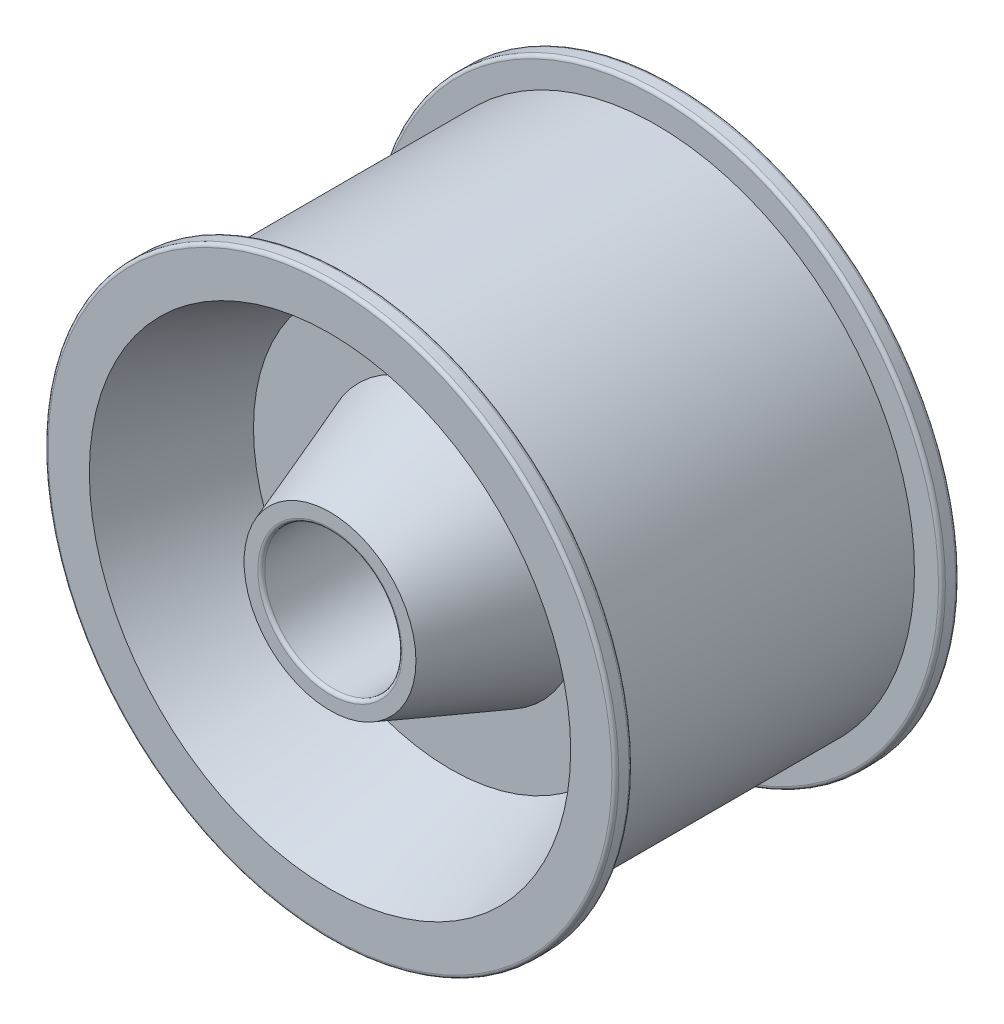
from build123d import *


with BuildPart() as part:
    # Skizze1 → Rotation1 (revolve)
    with BuildSketch(Plane(origin=(0, 0, 0), x_dir=(0, 0, -1), z_dir=(1, 0, 0)), mode=Mode.PRIVATE) as rotation1_sk:
        with BuildLine():
            Line((49, 20), (-49, 20))
            ThreePointArc((-49, 20), (-49.707106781, 20.292893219), (-50, 21))
            Line((-50, 21), (-50, 25))
            Line((-50, 25), (-15, 37.738958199))
            Line((-15, 37.738958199), (-15, 57.261041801))
            Line((-15, 57.261041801), (-50, 70))
            Line((-50, 70), (-50, 82))
            ThreePointArc((-50, 82), (-49.707106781, 82.707106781), (-49, 83))
            Line((-49, 83), (-46, 83))
            ThreePointArc((-46, 83), (-45.292893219, 82.707106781), (-45, 82))
            Line((-45, 82), (-45, 75))
            Line((-45, 75), (45, 75))
            Line((45, 75), (45, 82))
            ThreePointArc((45, 82), (45.292893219, 82.707106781), (46, 83))
            Line((46, 83), (49, 83))
            ThreePointArc((49, 83), (49.707106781, 82.707106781), (50, 82))
            Line((50, 82), (50, 70))
            Line((50, 70), (15, 57.261041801))
            Line((15, 57.261041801), (15, 37.738958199))
            Line((15, 37.738958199), (50, 25))
            Line((50, 25), (50, 21))
            ThreePointArc((50, 21), (49.707106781, 20.292893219), (49, 20))
        make_face()
    revolve(rotation1_sk.sketch.rotate(Axis((0, 0, 69.010416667), (0, 0, -1)), 90), axis=Axis((0, 0, 69.010416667), (0, 0, -1)))


solid = part.part
